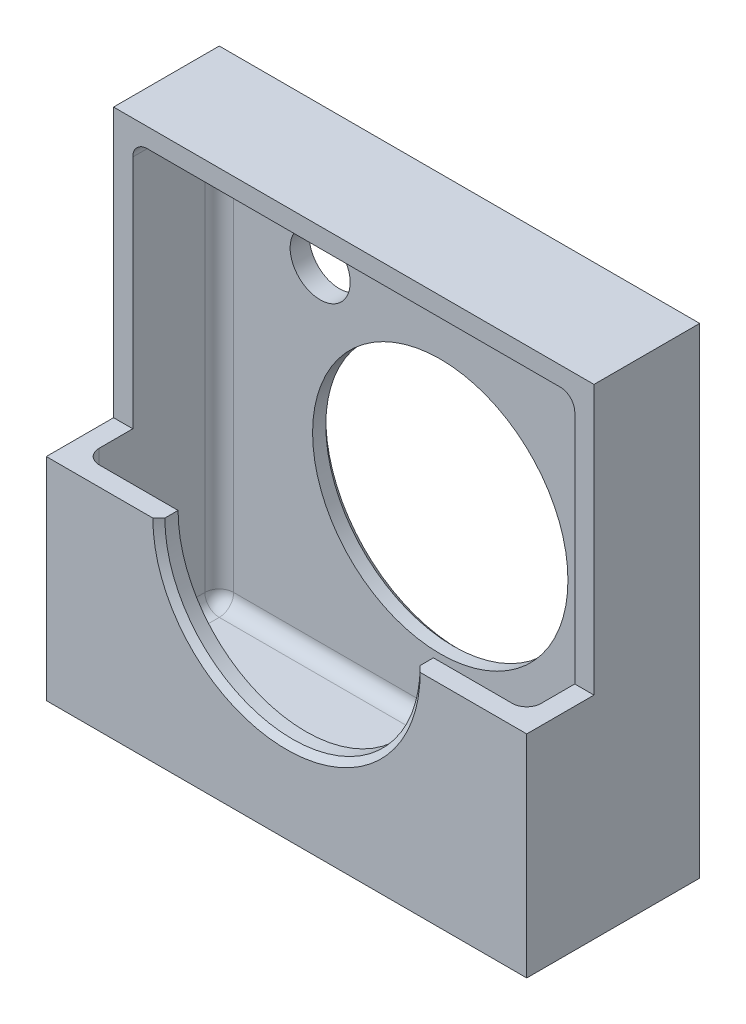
from build123d import *

# Parameters (mm, degrees)
SKETCH1_W          = 50.8
SKETCH1_H          = 50.8
MAIN_BODY_DEPTH    = 18.288
SKETCH2_W          = 7.112
SKETCH2_H          = 28.448
FRONT_CUT_DEPTH    = 75.133197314
SHELL1_T           = -2.032
SKETCH3_R          = 13.5001
CENTER_HOLE_DEPTH  = 75.133197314
FILL060_VERT_R     = 1.524
FILL060_TB_R       = 1.524
CHAM025_SIZE       = 0.635
KEYED_HOLE_1_DEPTH = 58.653742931


with BuildPart() as part:
    # Sketch1 → main body (new body)
    with BuildSketch(Plane.XY):
        with Locations((25.4, 25.4)):
            Rectangle(SKETCH1_W, SKETCH1_H)
    extrude(amount=MAIN_BODY_DEPTH)

    # Sketch2 → front cut (cut, through all)
    with BuildSketch(Plane(origin=(50.8, 0, 0), x_dir=(0, 0, -1), z_dir=(1, 0, 0))):
        with Locations((-14.732, 36.576)):
            Rectangle(SKETCH2_W, SKETCH2_H)
    extrude(amount=-FRONT_CUT_DEPTH, mode=Mode.SUBTRACT)

    # Shell1
    shell1_openings = [part.faces().sort_by_distance(p)[0] for p in [
        (25.4, 36.576, 11.176),
        (25.4, 22.352, 14.732),
    ]]
    offset(amount=SHELL1_T, openings=shell1_openings, kind=Kind.INTERSECTION)

    # Sketch3 → center hole (cut, through all)
    with BuildSketch(Plane.XY):
        with Locations((25.4, 22.352)):
            Circle(SKETCH3_R)
    extrude(amount=CENTER_HOLE_DEPTH, mode=Mode.SUBTRACT)

    # fill060.vert
    fill060_vert_edges = [part.edges().sort_by_distance(p)[0] for p in [
        (2.032, 12.192, 16.256),
        (48.768, 12.192, 16.256),
        (2.032, 25.4, 2.032),
        (48.768, 25.4, 2.032),
    ]]
    fillet(fill060_vert_edges, radius=FILL060_VERT_R)

    # fill060.tb
    fill060_tb_edges = [part.edges().sort_by_distance(p)[0] for p in [
        (2.032, 48.768, 7.366),
        (48.768, 48.768, 7.366),
        (25.4, 2.032, 16.256),
        (25.4, 2.032, 2.032),
        (2.032, 2.032, 9.144),
        (48.768, 2.032, 9.144),
        (2.478369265, 2.032, 15.809630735),
        (2.478369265, 2.032, 2.478369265),
        (48.321630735, 2.032, 2.478369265),
        (48.321630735, 2.032, 15.809630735),
        (25.4, 48.768, 2.032),
        (2.478369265, 48.768, 2.478369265),
        (48.321630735, 48.768, 2.478369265),
    ]]
    fillet(fill060_tb_edges, radius=FILL060_TB_R)

    # cham025
    cham025_edges = [part.edges().sort_by_distance(p)[0] for p in [
        (11.8999, 22.352, 0),
        (25.4, 8.8519, 18.288),
    ]]
    chamfer(cham025_edges, length=CHAM025_SIZE)

    # Sketch6 → Keyed Hole 1 (cut, through all)
    with BuildSketch(Plane(origin=(13.426773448, 39.909210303, 0), x_dir=(0, 1, 0), z_dir=(0, 0, -1))):
        with BuildLine():
            Line((1.238789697, 0.162226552), (2.635789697, 0.162226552))
            Line((2.635789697, 0.162226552), (2.635789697, -1.615773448))
            Line((2.635789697, -1.615773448), (1.238789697, -1.615773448))
            ThreePointArc((1.238789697, -1.615773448), (-4.984210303, -0.726773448), (1.238789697, 0.162226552))
        make_face()
    extrude(amount=-KEYED_HOLE_1_DEPTH, mode=Mode.SUBTRACT)


solid = part.part
